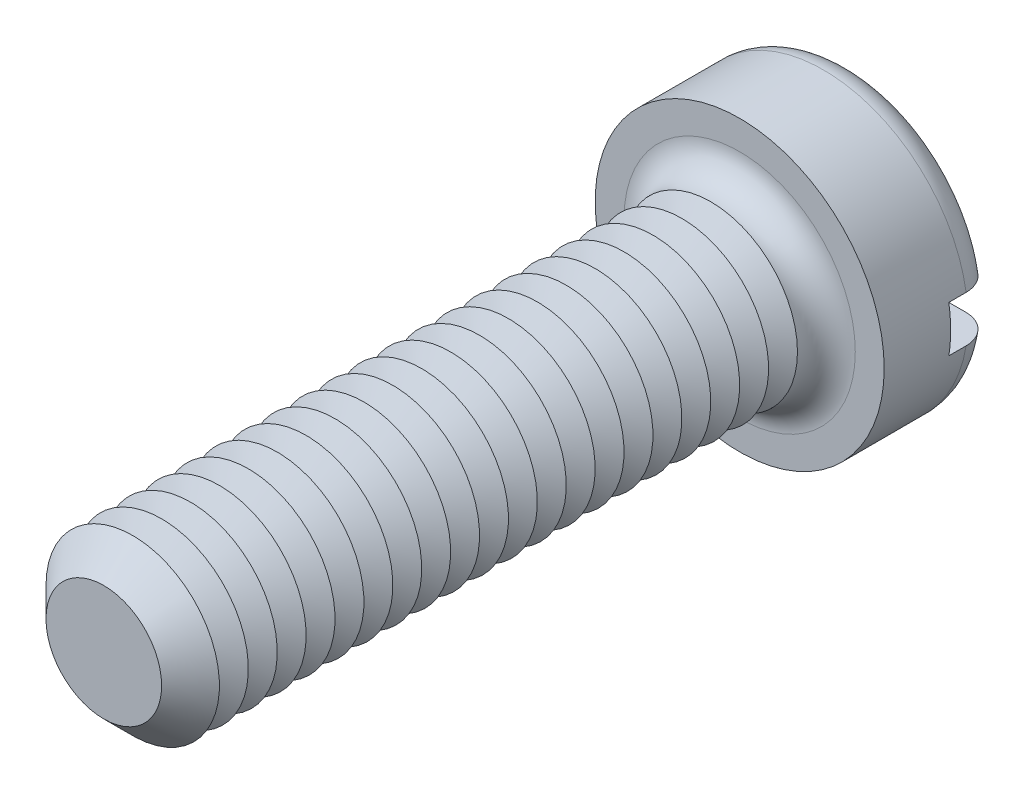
from build123d import *

# Parameters (mm, degrees)
SKETCH3_R           = 5
BOSS_EXTRUDE2_DEPTH = 3.9
SKETCH4_R           = 3
BOSS_EXTRUDE3_DEPTH = 22
FILLET1_R           = 1
CHAMFER1_SIZE       = 1
LPATTERN1_COUNT     = 20
LPATTERN1_PITCH     = 1
SKETCH8_W           = 10
SKETCH8_H           = 1.6
CUT_EXTRUDE1_DEPTH  = 1.6


with BuildPart() as part:
    # Sketch3 → Boss-Extrude2 (new body)
    with BuildSketch(Plane.XY):
        Circle(SKETCH3_R)
    extrude(amount=-BOSS_EXTRUDE2_DEPTH)

    # Sketch4 → Boss-Extrude3 (add)
    with BuildSketch(Plane.XY):
        Circle(SKETCH4_R)
    extrude(amount=BOSS_EXTRUDE3_DEPTH)

    # Fillet1
    fillet1_edges = [part.edges().sort_by_distance(p)[0] for p in [
        (-5, 0, -3.9),
        (-3, 0, 0),
    ]]
    fillet(fillet1_edges, radius=FILLET1_R)

    # Chamfer1
    chamfer1_edges = [part.edges().sort_by_distance(p)[0] for p in [
        (-3, 0, 22),
    ]]
    chamfer(chamfer1_edges, length=CHAMFER1_SIZE)

    # Sketch6 → Cut-Revolve1 (revolve, cut)
    with BuildSketch(Plane(origin=(0, 0, 0), x_dir=(0, 0, -1), z_dir=(1, 0, 0)), mode=Mode.PRIVATE) as cut_revolve1_sk:
        Polygon((-1, 3), (-1.5, 2.133974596), (-2, 3), align=None)
    cut_revolve1 = revolve(cut_revolve1_sk.sketch.rotate(Axis((0, 0, -1.694361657), (0, 0, 1)), 90), axis=Axis((0, 0, -1.694361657), (0, 0, 1)), mode=Mode.SUBTRACT)

    # LPattern1: Cut-Revolve1 ×20
    with Locations(*[(0, 0, i * LPATTERN1_PITCH) for i in range(1, LPATTERN1_COUNT)]):
        add(cut_revolve1, mode=Mode.SUBTRACT)

    # Sketch8 → Cut-Extrude1 (cut)
    with BuildSketch(Plane(origin=(0, 0, -3.9), x_dir=(-1, 0, 0), z_dir=(0, 0, -1))):
        Rectangle(SKETCH8_W, SKETCH8_H)
    extrude(amount=-CUT_EXTRUDE1_DEPTH, mode=Mode.SUBTRACT)


solid = part.part
